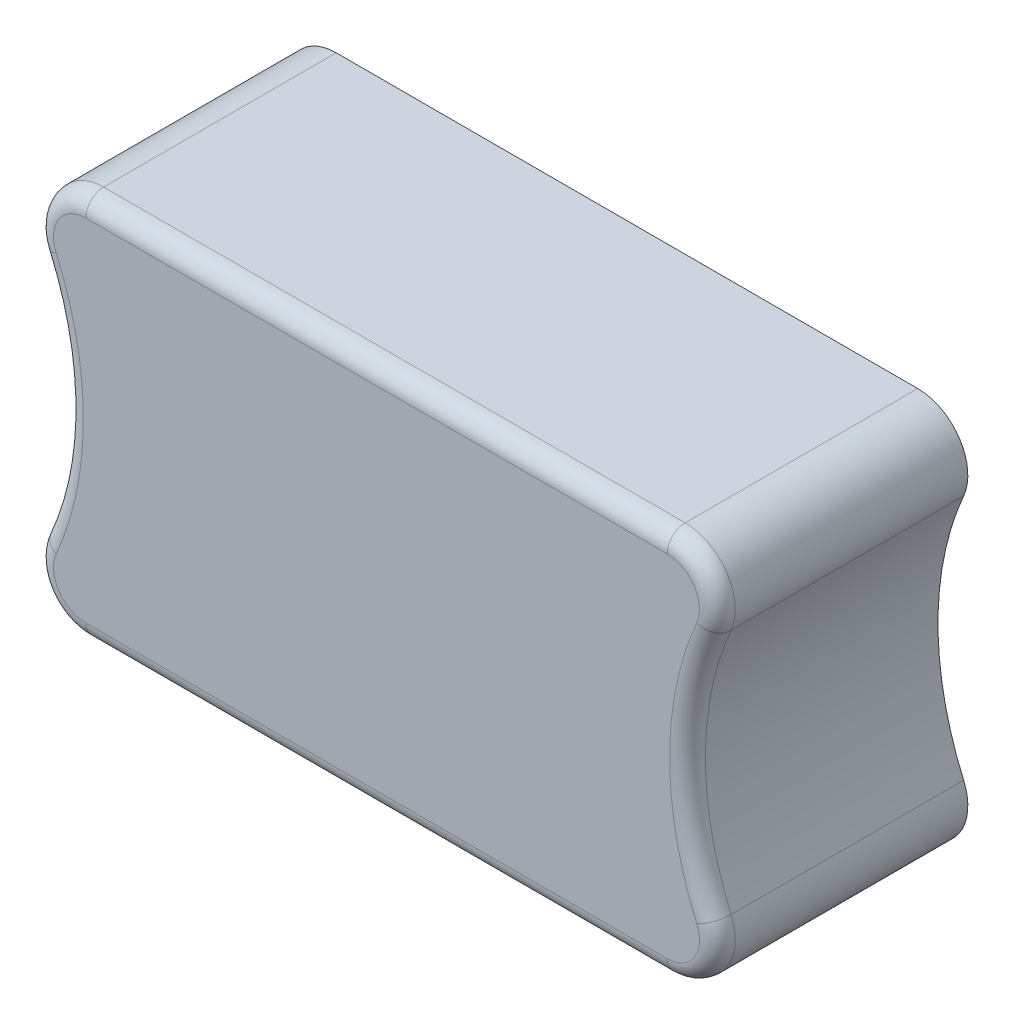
from build123d import *

# Parameters (mm, degrees)
SALIENTE_EXTRUIR2_DEPTH = 35
REDONDEO1_R             = 2.5
VACIADO1_T              = -3


with BuildPart() as part:
    # Croquis1 → Saliente-Extruir2 (new body)
    with BuildSketch(Plane.XY):
        with BuildLine():
            Line((-40.631756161, 27), (40.631756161, 27))
            ThreePointArc((40.631756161, 27), (46.488376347, 23.834057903), (47.047362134, 17.2))
            ThreePointArc((47.047362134, 17.2), (43.457513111, 0), (47.047362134, -17.2))
            ThreePointArc((47.047362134, -17.2), (46.488376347, -23.834057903), (40.631756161, -27))
            Line((40.631756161, -27), (-40.631756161, -27))
            ThreePointArc((-40.631756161, -27), (-46.488376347, -23.834057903), (-47.047362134, -17.2))
            ThreePointArc((-47.047362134, -17.2), (-43.457513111, 0), (-47.047362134, 17.2))
            ThreePointArc((-47.047362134, 17.2), (-46.488376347, 23.834057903), (-40.631756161, 27))
        make_face()
    extrude(amount=-SALIENTE_EXTRUIR2_DEPTH)

    # Redondeo1
    redondeo1_edges = [part.edges().sort_by_distance(p)[0] for p in [
        (-46.488376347, 23.834057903, 0),
        (0, 27, 0),
        (46.488376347, 23.834057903, 0),
        (43.457513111, 0, 0),
        (46.488376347, -23.834057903, 0),
        (0, -27, 0),
        (-46.488376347, -23.834057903, 0),
        (-43.457513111, 0, 0),
    ]]
    fillet(redondeo1_edges, radius=REDONDEO1_R)

    # Vaciado1
    vaciado1_openings = [part.faces().sort_by_distance(p)[0] for p in [
        (0, 0, -35),
    ]]
    offset(amount=VACIADO1_T, openings=vaciado1_openings, kind=Kind.INTERSECTION)


solid = part.part
